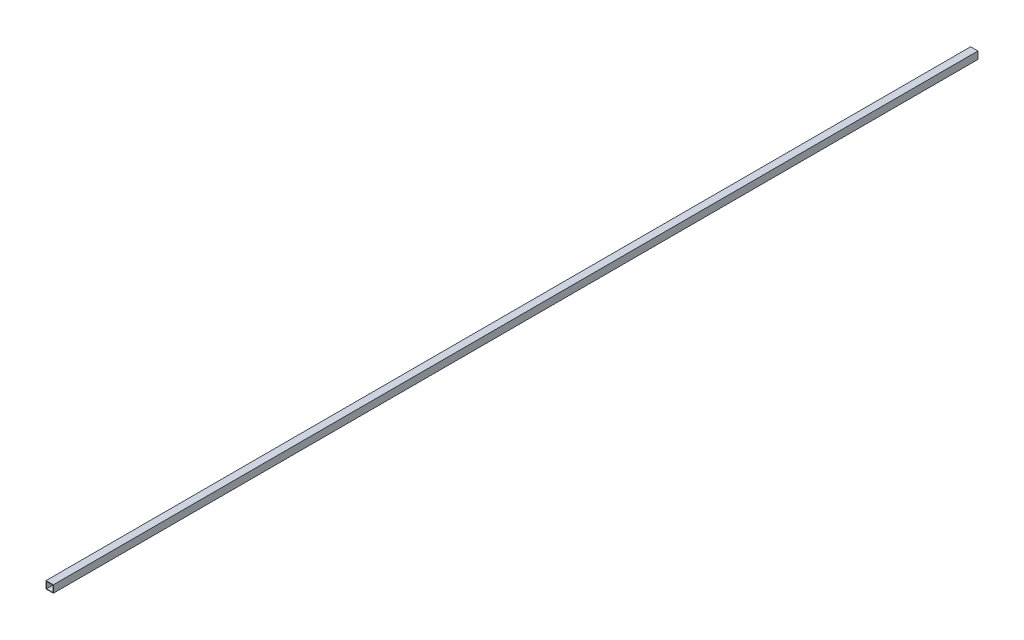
ISO-10303-21;
HEADER;
FILE_DESCRIPTION(('STEP AP214'),'2;1');
FILE_NAME('part.step','',(''),(''),'','','');
FILE_SCHEMA(('AUTOMOTIVE_DESIGN { 1 0 10303 214 1 1 1 1 }'));
ENDSEC;
DATA;
#1=APPLICATION_CONTEXT('core data for automotive mechanical design processes');
#2=APPLICATION_PROTOCOL_DEFINITION('international standard','automotive_design',2000,#1);
#3=PRODUCT_CONTEXT('',#1,'mechanical');
#4=PRODUCT('Part','Part','',(#3));
#5=PRODUCT_RELATED_PRODUCT_CATEGORY('part','',(#4));
#6=PRODUCT_DEFINITION_FORMATION('','',#4);
#7=PRODUCT_DEFINITION_CONTEXT('part definition',#1,'design');
#8=PRODUCT_DEFINITION('design','',#6,#7);
#9=PRODUCT_DEFINITION_SHAPE('','',#8);
#10=(LENGTH_UNIT() NAMED_UNIT(*) SI_UNIT(.MILLI.,.METRE.));
#11=(NAMED_UNIT(*) PLANE_ANGLE_UNIT() SI_UNIT($,.RADIAN.));
#12=(NAMED_UNIT(*) SI_UNIT($,.STERADIAN.) SOLID_ANGLE_UNIT());
#13=UNCERTAINTY_MEASURE_WITH_UNIT(LENGTH_MEASURE(1.E-05),#10,'distance_accuracy_value','');
#14=(GEOMETRIC_REPRESENTATION_CONTEXT(3) GLOBAL_UNCERTAINTY_ASSIGNED_CONTEXT((#13)) GLOBAL_UNIT_ASSIGNED_CONTEXT((#10,
#11,#12)) REPRESENTATION_CONTEXT('',''));
#15=CARTESIAN_POINT('',(0.,0.,0.));
#16=DIRECTION('',(0.,0.,1.));
#17=DIRECTION('',(1.,0.,0.));
#18=AXIS2_PLACEMENT_3D('',#15,#16,#17);
#19=CARTESIAN_POINT('',(-40.,40.,-10080.));
#20=DIRECTION('',(-1.,0.,0.));
#21=DIRECTION('',(0.,-1.,0.));
#22=AXIS2_PLACEMENT_3D('',#19,#20,#21);
#23=PLANE('',#22);
#24=DIRECTION('',(0.,-1.,0.));
#25=VECTOR('',#24,1.);
#26=CARTESIAN_POINT('',(-40.,40.,0.));
#27=LINE('',#26,#25);
#28=CARTESIAN_POINT('',(-40.,40.,0.));
#29=VERTEX_POINT('',#28);
#30=CARTESIAN_POINT('',(-40.,-40.,0.));
#31=VERTEX_POINT('',#30);
#32=EDGE_CURVE('E137',#29,#31,#27,.T.);
#33=ORIENTED_EDGE('',*,*,#32,.F.);
#34=DIRECTION('',(0.,0.,1.));
#35=VECTOR('',#34,1.);
#36=CARTESIAN_POINT('',(-40.,40.,-10080.));
#37=LINE('',#36,#35);
#38=CARTESIAN_POINT('',(-40.,40.,-10080.));
#39=VERTEX_POINT('',#38);
#40=EDGE_CURVE('E11',#39,#29,#37,.T.);
#41=ORIENTED_EDGE('',*,*,#40,.F.);
#42=DIRECTION('',(0.,-1.,0.));
#43=VECTOR('',#42,1.);
#44=CARTESIAN_POINT('',(-40.,40.,-10080.));
#45=LINE('',#44,#43);
#46=CARTESIAN_POINT('',(-40.,-40.,-10080.));
#47=VERTEX_POINT('',#46);
#48=EDGE_CURVE('E141',#39,#47,#45,.T.);
#49=ORIENTED_EDGE('',*,*,#48,.T.);
#50=DIRECTION('',(0.,0.,1.));
#51=VECTOR('',#50,1.);
#52=CARTESIAN_POINT('',(-40.,-40.,-10080.));
#53=LINE('',#52,#51);
#54=EDGE_CURVE('E42',#47,#31,#53,.T.);
#55=ORIENTED_EDGE('',*,*,#54,.T.);
#56=EDGE_LOOP('',(#33,#41,#49,#55));
#57=FACE_BOUND('',#56,.T.);
#58=ADVANCED_FACE('F39',(#57),#23,.T.);
#59=CARTESIAN_POINT('',(-40.,40.,-10080.));
#60=DIRECTION('',(0.,1.,0.));
#61=DIRECTION('',(0.,0.,1.));
#62=AXIS2_PLACEMENT_3D('',#59,#60,#61);
#63=PLANE('',#62);
#64=DIRECTION('',(-1.,0.,0.));
#65=VECTOR('',#64,1.);
#66=CARTESIAN_POINT('',(-40.,40.,0.));
#67=LINE('',#66,#65);
#68=CARTESIAN_POINT('',(40.,40.,0.));
#69=VERTEX_POINT('',#68);
#70=EDGE_CURVE('E145',#69,#29,#67,.T.);
#71=ORIENTED_EDGE('',*,*,#70,.F.);
#72=DIRECTION('',(0.,0.,1.));
#73=VECTOR('',#72,1.);
#74=CARTESIAN_POINT('',(40.,40.,-10080.));
#75=LINE('',#74,#73);
#76=CARTESIAN_POINT('',(40.,40.,-10080.));
#77=VERTEX_POINT('',#76);
#78=EDGE_CURVE('E47',#77,#69,#75,.T.);
#79=ORIENTED_EDGE('',*,*,#78,.F.);
#80=DIRECTION('',(-1.,0.,0.));
#81=VECTOR('',#80,1.);
#82=CARTESIAN_POINT('',(-40.,40.,-10080.));
#83=LINE('',#82,#81);
#84=EDGE_CURVE('E151',#77,#39,#83,.T.);
#85=ORIENTED_EDGE('',*,*,#84,.T.);
#86=ORIENTED_EDGE('',*,*,#40,.T.);
#87=EDGE_LOOP('',(#71,#79,#85,#86));
#88=FACE_BOUND('',#87,.T.);
#89=ADVANCED_FACE('F177',(#88),#63,.T.);
#90=CARTESIAN_POINT('',(40.,40.,-10080.));
#91=DIRECTION('',(1.,0.,0.));
#92=DIRECTION('',(0.,1.,0.));
#93=AXIS2_PLACEMENT_3D('',#90,#91,#92);
#94=PLANE('',#93);
#95=DIRECTION('',(0.,1.,0.));
#96=VECTOR('',#95,1.);
#97=CARTESIAN_POINT('',(40.,40.,0.));
#98=LINE('',#97,#96);
#99=CARTESIAN_POINT('',(40.,-40.,0.));
#100=VERTEX_POINT('',#99);
#101=EDGE_CURVE('E159',#100,#69,#98,.T.);
#102=ORIENTED_EDGE('',*,*,#101,.F.);
#103=DIRECTION('',(0.,0.,1.));
#104=VECTOR('',#103,1.);
#105=CARTESIAN_POINT('',(40.,-40.,-10080.));
#106=LINE('',#105,#104);
#107=CARTESIAN_POINT('',(40.,-40.,-10080.));
#108=VERTEX_POINT('',#107);
#109=EDGE_CURVE('E164',#108,#100,#106,.T.);
#110=ORIENTED_EDGE('',*,*,#109,.F.);
#111=DIRECTION('',(0.,1.,0.));
#112=VECTOR('',#111,1.);
#113=CARTESIAN_POINT('',(40.,40.,-10080.));
#114=LINE('',#113,#112);
#115=EDGE_CURVE('E148',#108,#77,#114,.T.);
#116=ORIENTED_EDGE('',*,*,#115,.T.);
#117=ORIENTED_EDGE('',*,*,#78,.T.);
#118=EDGE_LOOP('',(#102,#110,#116,#117));
#119=FACE_BOUND('',#118,.T.);
#120=ADVANCED_FACE('F181',(#119),#94,.T.);
#121=CARTESIAN_POINT('',(-40.,-40.,-10080.));
#122=DIRECTION('',(0.,-1.,0.));
#123=DIRECTION('',(0.,0.,-1.));
#124=AXIS2_PLACEMENT_3D('',#121,#122,#123);
#125=PLANE('',#124);
#126=DIRECTION('',(1.,0.,0.));
#127=VECTOR('',#126,1.);
#128=CARTESIAN_POINT('',(-40.,-40.,0.));
#129=LINE('',#128,#127);
#130=EDGE_CURVE('E156',#31,#100,#129,.T.);
#131=ORIENTED_EDGE('',*,*,#130,.F.);
#132=ORIENTED_EDGE('',*,*,#54,.F.);
#133=DIRECTION('',(1.,0.,0.));
#134=VECTOR('',#133,1.);
#135=CARTESIAN_POINT('',(-40.,-40.,-10080.));
#136=LINE('',#135,#134);
#137=EDGE_CURVE('E144',#47,#108,#136,.T.);
#138=ORIENTED_EDGE('',*,*,#137,.T.);
#139=ORIENTED_EDGE('',*,*,#109,.T.);
#140=EDGE_LOOP('',(#131,#132,#138,#139));
#141=FACE_BOUND('',#140,.T.);
#142=ADVANCED_FACE('F172',(#141),#125,.T.);
#143=CARTESIAN_POINT('',(0.,0.,-10080.));
#144=DIRECTION('',(0.,0.,1.));
#145=DIRECTION('',(1.,0.,0.));
#146=AXIS2_PLACEMENT_3D('',#143,#144,#145);
#147=PLANE('',#146);
#148=DIRECTION('',(-1.,0.,0.));
#149=VECTOR('',#148,1.);
#150=CARTESIAN_POINT('',(-35.,35.,-10080.));
#151=LINE('',#150,#149);
#152=CARTESIAN_POINT('',(35.,35.,-10080.));
#153=VERTEX_POINT('',#152);
#154=CARTESIAN_POINT('',(-35.,35.,-10080.));
#155=VERTEX_POINT('',#154);
#156=EDGE_CURVE('E112',#153,#155,#151,.T.);
#157=ORIENTED_EDGE('',*,*,#156,.T.);
#158=DIRECTION('',(0.,-1.,0.));
#159=VECTOR('',#158,1.);
#160=CARTESIAN_POINT('',(-35.,35.,-10080.));
#161=LINE('',#160,#159);
#162=CARTESIAN_POINT('',(-35.,-35.,-10080.));
#163=VERTEX_POINT('',#162);
#164=EDGE_CURVE('E106',#155,#163,#161,.T.);
#165=ORIENTED_EDGE('',*,*,#164,.T.);
#166=DIRECTION('',(1.,0.,0.));
#167=VECTOR('',#166,1.);
#168=CARTESIAN_POINT('',(-35.,-35.,-10080.));
#169=LINE('',#168,#167);
#170=CARTESIAN_POINT('',(35.,-35.,-10080.));
#171=VERTEX_POINT('',#170);
#172=EDGE_CURVE('E115',#163,#171,#169,.T.);
#173=ORIENTED_EDGE('',*,*,#172,.T.);
#174=DIRECTION('',(0.,1.,0.));
#175=VECTOR('',#174,1.);
#176=CARTESIAN_POINT('',(35.,35.,-10080.));
#177=LINE('',#176,#175);
#178=EDGE_CURVE('E55',#171,#153,#177,.T.);
#179=ORIENTED_EDGE('',*,*,#178,.T.);
#180=EDGE_LOOP('',(#157,#165,#173,#179));
#181=FACE_BOUND('',#180,.T.);
#182=ORIENTED_EDGE('',*,*,#48,.F.);
#183=ORIENTED_EDGE('',*,*,#84,.F.);
#184=ORIENTED_EDGE('',*,*,#115,.F.);
#185=ORIENTED_EDGE('',*,*,#137,.F.);
#186=EDGE_LOOP('',(#182,#183,#184,#185));
#187=FACE_BOUND('',#186,.T.);
#188=ADVANCED_FACE('F119',(#181,#187),#147,.F.);
#189=CARTESIAN_POINT('',(0.,0.,0.));
#190=DIRECTION('',(0.,0.,1.));
#191=DIRECTION('',(1.,0.,0.));
#192=AXIS2_PLACEMENT_3D('',#189,#190,#191);
#193=PLANE('',#192);
#194=DIRECTION('',(0.,-1.,0.));
#195=VECTOR('',#194,1.);
#196=CARTESIAN_POINT('',(-35.,35.,0.));
#197=LINE('',#196,#195);
#198=CARTESIAN_POINT('',(-35.,35.,0.));
#199=VERTEX_POINT('',#198);
#200=CARTESIAN_POINT('',(-35.,-35.,0.));
#201=VERTEX_POINT('',#200);
#202=EDGE_CURVE('E63',#199,#201,#197,.T.);
#203=ORIENTED_EDGE('',*,*,#202,.F.);
#204=DIRECTION('',(-1.,0.,0.));
#205=VECTOR('',#204,1.);
#206=CARTESIAN_POINT('',(-35.,35.,0.));
#207=LINE('',#206,#205);
#208=CARTESIAN_POINT('',(35.,35.,0.));
#209=VERTEX_POINT('',#208);
#210=EDGE_CURVE('E122',#209,#199,#207,.T.);
#211=ORIENTED_EDGE('',*,*,#210,.F.);
#212=DIRECTION('',(0.,1.,0.));
#213=VECTOR('',#212,1.);
#214=CARTESIAN_POINT('',(35.,35.,0.));
#215=LINE('',#214,#213);
#216=CARTESIAN_POINT('',(35.,-35.,0.));
#217=VERTEX_POINT('',#216);
#218=EDGE_CURVE('E125',#217,#209,#215,.T.);
#219=ORIENTED_EDGE('',*,*,#218,.F.);
#220=DIRECTION('',(1.,0.,0.));
#221=VECTOR('',#220,1.);
#222=CARTESIAN_POINT('',(-35.,-35.,0.));
#223=LINE('',#222,#221);
#224=EDGE_CURVE('E131',#201,#217,#223,.T.);
#225=ORIENTED_EDGE('',*,*,#224,.F.);
#226=EDGE_LOOP('',(#203,#211,#219,#225));
#227=FACE_BOUND('',#226,.T.);
#228=ORIENTED_EDGE('',*,*,#32,.T.);
#229=ORIENTED_EDGE('',*,*,#130,.T.);
#230=ORIENTED_EDGE('',*,*,#101,.T.);
#231=ORIENTED_EDGE('',*,*,#70,.T.);
#232=EDGE_LOOP('',(#228,#229,#230,#231));
#233=FACE_BOUND('',#232,.T.);
#234=ADVANCED_FACE('F174',(#227,#233),#193,.T.);
#235=CARTESIAN_POINT('',(-35.,35.,-10080.));
#236=DIRECTION('',(-1.,0.,0.));
#237=DIRECTION('',(0.,-1.,0.));
#238=AXIS2_PLACEMENT_3D('',#235,#236,#237);
#239=PLANE('',#238);
#240=ORIENTED_EDGE('',*,*,#202,.T.);
#241=DIRECTION('',(0.,0.,1.));
#242=VECTOR('',#241,1.);
#243=CARTESIAN_POINT('',(-35.,-35.,-10080.));
#244=LINE('',#243,#242);
#245=EDGE_CURVE('E102',#163,#201,#244,.T.);
#246=ORIENTED_EDGE('',*,*,#245,.F.);
#247=ORIENTED_EDGE('',*,*,#164,.F.);
#248=DIRECTION('',(0.,0.,1.));
#249=VECTOR('',#248,1.);
#250=CARTESIAN_POINT('',(-35.,35.,-10080.));
#251=LINE('',#250,#249);
#252=EDGE_CURVE('E135',#155,#199,#251,.T.);
#253=ORIENTED_EDGE('',*,*,#252,.T.);
#254=EDGE_LOOP('',(#240,#246,#247,#253));
#255=FACE_BOUND('',#254,.T.);
#256=ADVANCED_FACE('F104',(#255),#239,.F.);
#257=CARTESIAN_POINT('',(-35.,35.,-10080.));
#258=DIRECTION('',(0.,1.,0.));
#259=DIRECTION('',(0.,0.,1.));
#260=AXIS2_PLACEMENT_3D('',#257,#258,#259);
#261=PLANE('',#260);
#262=ORIENTED_EDGE('',*,*,#210,.T.);
#263=ORIENTED_EDGE('',*,*,#252,.F.);
#264=ORIENTED_EDGE('',*,*,#156,.F.);
#265=DIRECTION('',(0.,0.,1.));
#266=VECTOR('',#265,1.);
#267=CARTESIAN_POINT('',(35.,35.,-10080.));
#268=LINE('',#267,#266);
#269=EDGE_CURVE('E138',#153,#209,#268,.T.);
#270=ORIENTED_EDGE('',*,*,#269,.T.);
#271=EDGE_LOOP('',(#262,#263,#264,#270));
#272=FACE_BOUND('',#271,.T.);
#273=ADVANCED_FACE('F232',(#272),#261,.F.);
#274=CARTESIAN_POINT('',(35.,35.,-10080.));
#275=DIRECTION('',(1.,0.,0.));
#276=DIRECTION('',(0.,0.,-1.));
#277=AXIS2_PLACEMENT_3D('',#274,#275,#276);
#278=PLANE('',#277);
#279=ORIENTED_EDGE('',*,*,#218,.T.);
#280=ORIENTED_EDGE('',*,*,#269,.F.);
#281=ORIENTED_EDGE('',*,*,#178,.F.);
#282=DIRECTION('',(0.,0.,1.));
#283=VECTOR('',#282,1.);
#284=CARTESIAN_POINT('',(35.,-35.,-10080.));
#285=LINE('',#284,#283);
#286=EDGE_CURVE('E111',#171,#217,#285,.T.);
#287=ORIENTED_EDGE('',*,*,#286,.T.);
#288=EDGE_LOOP('',(#279,#280,#281,#287));
#289=FACE_BOUND('',#288,.T.);
#290=ADVANCED_FACE('F241',(#289),#278,.F.);
#291=CARTESIAN_POINT('',(-35.,-35.,-10080.));
#292=DIRECTION('',(0.,-1.,0.));
#293=DIRECTION('',(1.,0.,0.));
#294=AXIS2_PLACEMENT_3D('',#291,#292,#293);
#295=PLANE('',#294);
#296=ORIENTED_EDGE('',*,*,#224,.T.);
#297=ORIENTED_EDGE('',*,*,#286,.F.);
#298=ORIENTED_EDGE('',*,*,#172,.F.);
#299=ORIENTED_EDGE('',*,*,#245,.T.);
#300=EDGE_LOOP('',(#296,#297,#298,#299));
#301=FACE_BOUND('',#300,.T.);
#302=ADVANCED_FACE('F116',(#301),#295,.F.);
#303=CLOSED_SHELL('',(#58,#89,#120,#142,#188,#234,#256,#273,#290,#302));
#304=MANIFOLD_SOLID_BREP('B2',#303);
#305=ADVANCED_BREP_SHAPE_REPRESENTATION('',(#18,#304),#14);
#306=SHAPE_DEFINITION_REPRESENTATION(#9,#305);
ENDSEC;
END-ISO-10303-21;
